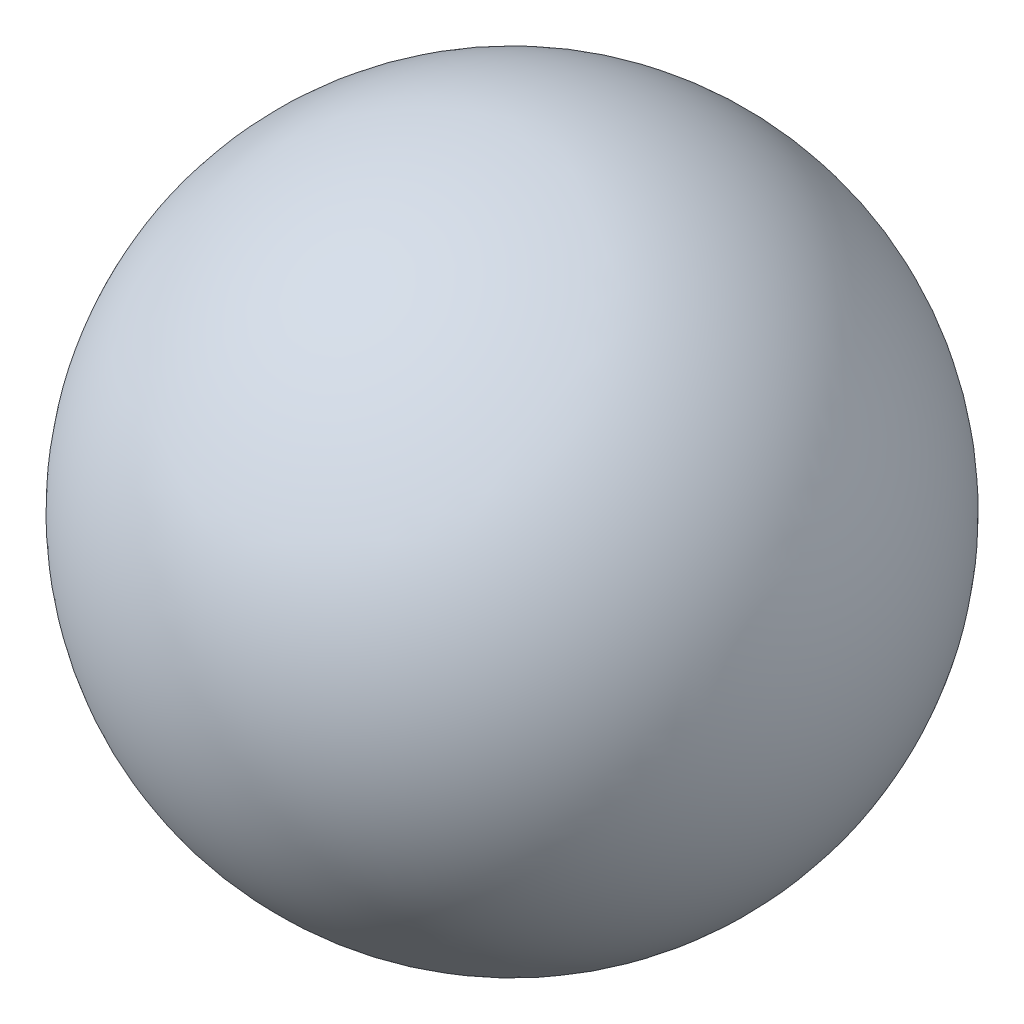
from build123d import *


with BuildPart() as part:
    # Sketch1 → Revolve1 (revolve)
    with BuildSketch(Plane.XY.offset(11.844038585)):
        with BuildLine():
            Line((-3.969, 11.844038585), (3.969, 11.844038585))
            ThreePointArc((3.969, 11.844038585), (0, 15.813038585), (-3.969, 11.844038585))
        make_face()
    revolve(axis=Axis((-3.969, 11.844038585, 11.844038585), (1, 0, 0)))


solid = part.part
